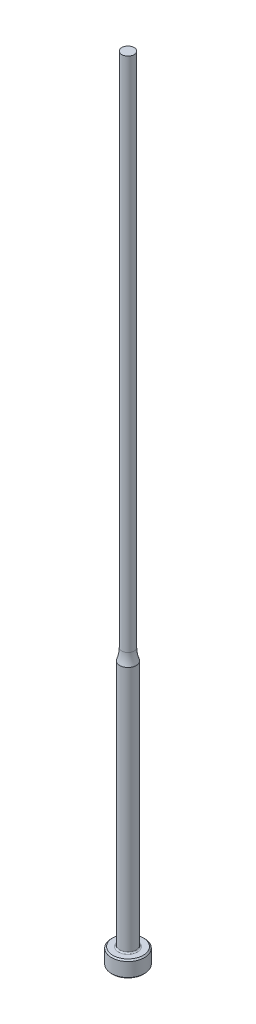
ISO-10303-21;
HEADER;
FILE_DESCRIPTION(('STEP AP214'),'2;1');
FILE_NAME('part.step','',(''),(''),'','','');
FILE_SCHEMA(('AUTOMOTIVE_DESIGN { 1 0 10303 214 1 1 1 1 }'));
ENDSEC;
DATA;
#1=APPLICATION_CONTEXT('core data for automotive mechanical design processes');
#2=APPLICATION_PROTOCOL_DEFINITION('international standard','automotive_design',2000,#1);
#3=PRODUCT_CONTEXT('',#1,'mechanical');
#4=PRODUCT('Part','Part','',(#3));
#5=PRODUCT_RELATED_PRODUCT_CATEGORY('part','',(#4));
#6=PRODUCT_DEFINITION_FORMATION('','',#4);
#7=PRODUCT_DEFINITION_CONTEXT('part definition',#1,'design');
#8=PRODUCT_DEFINITION('design','',#6,#7);
#9=PRODUCT_DEFINITION_SHAPE('','',#8);
#10=(LENGTH_UNIT() NAMED_UNIT(*) SI_UNIT(.MILLI.,.METRE.));
#11=(NAMED_UNIT(*) PLANE_ANGLE_UNIT() SI_UNIT($,.RADIAN.));
#12=(NAMED_UNIT(*) SI_UNIT($,.STERADIAN.) SOLID_ANGLE_UNIT());
#13=UNCERTAINTY_MEASURE_WITH_UNIT(LENGTH_MEASURE(1.E-05),#10,'distance_accuracy_value','');
#14=(GEOMETRIC_REPRESENTATION_CONTEXT(3) GLOBAL_UNCERTAINTY_ASSIGNED_CONTEXT((#13)) GLOBAL_UNIT_ASSIGNED_CONTEXT((#10,
#11,#12)) REPRESENTATION_CONTEXT('',''));
#15=CARTESIAN_POINT('',(0.,0.,0.));
#16=DIRECTION('',(0.,0.,1.));
#17=DIRECTION('',(1.,0.,0.));
#18=AXIS2_PLACEMENT_3D('',#15,#16,#17);
#19=CARTESIAN_POINT('',(-1.18998999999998,152.4,0.));
#20=DIRECTION('',(0.,1.,0.));
#21=DIRECTION('',(0.,0.,1.));
#22=AXIS2_PLACEMENT_3D('',#19,#20,#21);
#23=PLANE('',#22);
#24=CARTESIAN_POINT('',(0.,152.4,0.));
#25=DIRECTION('',(0.,1.,0.));
#26=DIRECTION('',(0.,0.,1.));
#27=AXIS2_PLACEMENT_3D('',#24,#25,#26);
#28=CIRCLE('',#27,1.18998999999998);
#29=CARTESIAN_POINT('',(0.,152.4,1.18998999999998));
#30=VERTEX_POINT('',#29);
#31=EDGE_CURVE('E61',#30,#30,#28,.T.);
#32=ORIENTED_EDGE('',*,*,#31,.T.);
#33=EDGE_LOOP('',(#32));
#34=FACE_BOUND('',#33,.T.);
#35=ADVANCED_FACE('F35',(#34),#23,.T.);
#36=CARTESIAN_POINT('',(0.,259.958771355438,0.));
#37=DIRECTION('',(0.,1.,0.));
#38=DIRECTION('',(0.,0.,1.));
#39=AXIS2_PLACEMENT_3D('',#36,#37,#38);
#40=CYLINDRICAL_SURFACE('',#39,1.18998999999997);
#41=CARTESIAN_POINT('',(0.,53.0114164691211,0.));
#42=DIRECTION('',(0.,1.,0.));
#43=DIRECTION('',(0.,0.,1.));
#44=AXIS2_PLACEMENT_3D('',#41,#42,#43);
#45=CIRCLE('',#44,1.18998999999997);
#46=CARTESIAN_POINT('',(0.,53.0114164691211,1.18998999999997));
#47=VERTEX_POINT('',#46);
#48=EDGE_CURVE('E64',#47,#47,#45,.T.);
#49=ORIENTED_EDGE('',*,*,#48,.T.);
#50=EDGE_LOOP('',(#49));
#51=FACE_BOUND('',#50,.T.);
#52=ORIENTED_EDGE('',*,*,#31,.F.);
#53=EDGE_LOOP('',(#52));
#54=FACE_BOUND('',#53,.T.);
#55=ADVANCED_FACE('F84',(#51,#54),#40,.T.);
#56=CARTESIAN_POINT('',(0.,53.0114164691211,0.));
#57=DIRECTION('',(0.,1.,0.));
#58=DIRECTION('',(0.,0.,1.));
#59=AXIS2_PLACEMENT_3D('',#56,#57,#58);
#60=TOROIDAL_SURFACE('',#59,7.53998999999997,6.35);
#61=CARTESIAN_POINT('',(0.,50.8,0.));
#62=DIRECTION('',(0.,1.,0.));
#63=DIRECTION('',(0.,0.,1.));
#64=AXIS2_PLACEMENT_3D('',#61,#62,#63);
#65=CIRCLE('',#64,1.58749999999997);
#66=CARTESIAN_POINT('',(0.,50.8,1.58749999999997));
#67=VERTEX_POINT('',#66);
#68=EDGE_CURVE('E67',#67,#67,#65,.T.);
#69=ORIENTED_EDGE('',*,*,#68,.T.);
#70=EDGE_LOOP('',(#69));
#71=FACE_BOUND('',#70,.T.);
#72=ORIENTED_EDGE('',*,*,#48,.F.);
#73=EDGE_LOOP('',(#72));
#74=FACE_BOUND('',#73,.T.);
#75=ADVANCED_FACE('F71',(#71,#74),#60,.F.);
#76=CARTESIAN_POINT('',(0.,259.958771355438,0.));
#77=DIRECTION('',(0.,1.,0.));
#78=DIRECTION('',(0.,0.,1.));
#79=AXIS2_PLACEMENT_3D('',#76,#77,#78);
#80=CYLINDRICAL_SURFACE('',#79,1.58749999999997);
#81=CARTESIAN_POINT('',(0.,3.42900000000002,0.));
#82=DIRECTION('',(0.,1.,0.));
#83=DIRECTION('',(0.,0.,1.));
#84=AXIS2_PLACEMENT_3D('',#81,#82,#83);
#85=CIRCLE('',#84,1.58749999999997);
#86=CARTESIAN_POINT('',(0.,3.42900000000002,1.58749999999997));
#87=VERTEX_POINT('',#86);
#88=EDGE_CURVE('E42',#87,#87,#85,.T.);
#89=ORIENTED_EDGE('',*,*,#88,.T.);
#90=EDGE_LOOP('',(#89));
#91=FACE_BOUND('',#90,.T.);
#92=ORIENTED_EDGE('',*,*,#68,.F.);
#93=EDGE_LOOP('',(#92));
#94=FACE_BOUND('',#93,.T.);
#95=ADVANCED_FACE('F74',(#91,#94),#80,.T.);
#96=CARTESIAN_POINT('',(-3.17499999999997,3.175,0.));
#97=DIRECTION('',(0.,1.,0.));
#98=DIRECTION('',(0.,0.,1.));
#99=AXIS2_PLACEMENT_3D('',#96,#97,#98);
#100=PLANE('',#99);
#101=CARTESIAN_POINT('',(0.,3.175,0.));
#102=DIRECTION('',(0.,1.,0.));
#103=DIRECTION('',(0.,0.,1.));
#104=AXIS2_PLACEMENT_3D('',#101,#102,#103);
#105=CIRCLE('',#104,1.84149999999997);
#106=CARTESIAN_POINT('',(0.,3.175,1.84149999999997));
#107=VERTEX_POINT('',#106);
#108=EDGE_CURVE('E10',#107,#107,#105,.F.);
#109=ORIENTED_EDGE('',*,*,#108,.T.);
#110=EDGE_LOOP('',(#109));
#111=FACE_BOUND('',#110,.T.);
#112=CARTESIAN_POINT('',(0.,3.175,0.));
#113=DIRECTION('',(0.,1.,0.));
#114=DIRECTION('',(0.,0.,1.));
#115=AXIS2_PLACEMENT_3D('',#112,#113,#114);
#116=CIRCLE('',#115,2.92099999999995);
#117=CARTESIAN_POINT('',(0.,3.175,2.92099999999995));
#118=VERTEX_POINT('',#117);
#119=EDGE_CURVE('E58',#118,#118,#116,.T.);
#120=ORIENTED_EDGE('',*,*,#119,.T.);
#121=EDGE_LOOP('',(#120));
#122=FACE_BOUND('',#121,.T.);
#123=ADVANCED_FACE('F76',(#111,#122),#100,.T.);
#124=CARTESIAN_POINT('',(0.,259.958771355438,0.));
#125=DIRECTION('',(0.,1.,0.));
#126=DIRECTION('',(0.,0.,1.));
#127=AXIS2_PLACEMENT_3D('',#124,#125,#126);
#128=CYLINDRICAL_SURFACE('',#127,3.17499999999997);
#129=CARTESIAN_POINT('',(0.,2.92100000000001,0.));
#130=DIRECTION('',(0.,1.,0.));
#131=DIRECTION('',(0.,0.,1.));
#132=AXIS2_PLACEMENT_3D('',#129,#130,#131);
#133=CIRCLE('',#132,3.17499999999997);
#134=CARTESIAN_POINT('',(0.,2.92100000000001,3.17499999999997));
#135=VERTEX_POINT('',#134);
#136=EDGE_CURVE('E50',#135,#135,#133,.F.);
#137=ORIENTED_EDGE('',*,*,#136,.T.);
#138=EDGE_LOOP('',(#137));
#139=FACE_BOUND('',#138,.T.);
#140=CARTESIAN_POINT('',(0.,0.254000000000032,0.));
#141=DIRECTION('',(0.,-1.,0.));
#142=DIRECTION('',(0.,0.,-1.));
#143=AXIS2_PLACEMENT_3D('',#140,#141,#142);
#144=CIRCLE('',#143,3.17499999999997);
#145=CARTESIAN_POINT('',(0.,0.254000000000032,-3.17499999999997));
#146=VERTEX_POINT('',#145);
#147=EDGE_CURVE('E55',#146,#146,#144,.F.);
#148=ORIENTED_EDGE('',*,*,#147,.T.);
#149=EDGE_LOOP('',(#148));
#150=FACE_BOUND('',#149,.T.);
#151=ADVANCED_FACE('F82',(#139,#150),#128,.T.);
#152=CARTESIAN_POINT('',(0.,0.,0.));
#153=DIRECTION('',(0.,-1.,0.));
#154=DIRECTION('',(0.,0.,-1.));
#155=AXIS2_PLACEMENT_3D('',#152,#153,#154);
#156=PLANE('',#155);
#157=CARTESIAN_POINT('',(0.,0.,0.));
#158=DIRECTION('',(0.,-1.,0.));
#159=DIRECTION('',(0.,0.,-1.));
#160=AXIS2_PLACEMENT_3D('',#157,#158,#159);
#161=CIRCLE('',#160,2.92099999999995);
#162=CARTESIAN_POINT('',(0.,0.,-2.92099999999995));
#163=VERTEX_POINT('',#162);
#164=EDGE_CURVE('E46',#163,#163,#161,.T.);
#165=ORIENTED_EDGE('',*,*,#164,.T.);
#166=EDGE_LOOP('',(#165));
#167=FACE_BOUND('',#166,.T.);
#168=ADVANCED_FACE('F98',(#167),#156,.T.);
#169=CARTESIAN_POINT('',(0.,3.17499999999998,0.));
#170=DIRECTION('',(0.,-1.,0.));
#171=DIRECTION('',(0.,0.,-1.));
#172=AXIS2_PLACEMENT_3D('',#169,#170,#171);
#173=CONICAL_SURFACE('',#172,2.92099999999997,0.7853981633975);
#174=ORIENTED_EDGE('',*,*,#136,.F.);
#175=EDGE_LOOP('',(#174));
#176=FACE_BOUND('',#175,.T.);
#177=ORIENTED_EDGE('',*,*,#119,.F.);
#178=EDGE_LOOP('',(#177));
#179=FACE_BOUND('',#178,.T.);
#180=ADVANCED_FACE('F95',(#176,#179),#173,.T.);
#181=CARTESIAN_POINT('',(0.,0.254000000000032,0.));
#182=DIRECTION('',(0.,1.,0.));
#183=DIRECTION('',(0.,0.,1.));
#184=AXIS2_PLACEMENT_3D('',#181,#182,#183);
#185=CONICAL_SURFACE('',#184,3.17499999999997,0.785398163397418);
#186=ORIENTED_EDGE('',*,*,#164,.F.);
#187=EDGE_LOOP('',(#186));
#188=FACE_BOUND('',#187,.T.);
#189=ORIENTED_EDGE('',*,*,#147,.F.);
#190=EDGE_LOOP('',(#189));
#191=FACE_BOUND('',#190,.T.);
#192=ADVANCED_FACE('F97',(#188,#191),#185,.T.);
#193=CARTESIAN_POINT('',(0.,3.42900000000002,0.));
#194=DIRECTION('',(0.,1.,0.));
#195=DIRECTION('',(0.,0.,1.));
#196=AXIS2_PLACEMENT_3D('',#193,#194,#195);
#197=TOROIDAL_SURFACE('',#196,1.84149999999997,0.254);
#198=ORIENTED_EDGE('',*,*,#108,.F.);
#199=EDGE_LOOP('',(#198));
#200=FACE_BOUND('',#199,.T.);
#201=ORIENTED_EDGE('',*,*,#88,.F.);
#202=EDGE_LOOP('',(#201));
#203=FACE_BOUND('',#202,.T.);
#204=ADVANCED_FACE('F37',(#200,#203),#197,.F.);
#205=CLOSED_SHELL('',(#35,#55,#75,#95,#123,#151,#168,#180,#192,#204));
#206=MANIFOLD_SOLID_BREP('B2',#205);
#207=ADVANCED_BREP_SHAPE_REPRESENTATION('',(#18,#206),#14);
#208=SHAPE_DEFINITION_REPRESENTATION(#9,#207);
ENDSEC;
END-ISO-10303-21;
